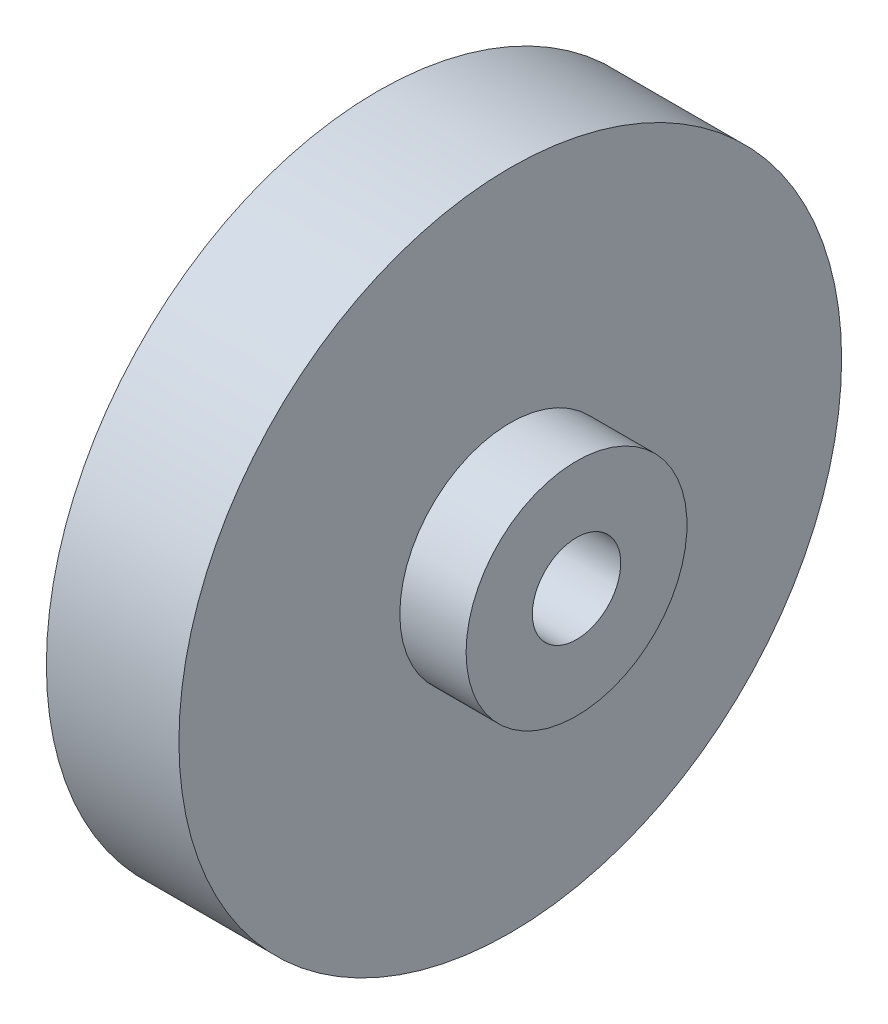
ISO-10303-21;
HEADER;
FILE_DESCRIPTION(('STEP AP214'),'2;1');
FILE_NAME('part.step','',(''),(''),'','','');
FILE_SCHEMA(('AUTOMOTIVE_DESIGN { 1 0 10303 214 1 1 1 1 }'));
ENDSEC;
DATA;
#1=APPLICATION_CONTEXT('core data for automotive mechanical design processes');
#2=APPLICATION_PROTOCOL_DEFINITION('international standard','automotive_design',2000,#1);
#3=PRODUCT_CONTEXT('',#1,'mechanical');
#4=PRODUCT('Part','Part','',(#3));
#5=PRODUCT_RELATED_PRODUCT_CATEGORY('part','',(#4));
#6=PRODUCT_DEFINITION_FORMATION('','',#4);
#7=PRODUCT_DEFINITION_CONTEXT('part definition',#1,'design');
#8=PRODUCT_DEFINITION('design','',#6,#7);
#9=PRODUCT_DEFINITION_SHAPE('','',#8);
#10=(LENGTH_UNIT() NAMED_UNIT(*) SI_UNIT(.MILLI.,.METRE.));
#11=(NAMED_UNIT(*) PLANE_ANGLE_UNIT() SI_UNIT($,.RADIAN.));
#12=(NAMED_UNIT(*) SI_UNIT($,.STERADIAN.) SOLID_ANGLE_UNIT());
#13=UNCERTAINTY_MEASURE_WITH_UNIT(LENGTH_MEASURE(1.E-05),#10,'distance_accuracy_value','');
#14=(GEOMETRIC_REPRESENTATION_CONTEXT(3) GLOBAL_UNCERTAINTY_ASSIGNED_CONTEXT((#13)) GLOBAL_UNIT_ASSIGNED_CONTEXT((#10,
#11,#12)) REPRESENTATION_CONTEXT('',''));
#15=CARTESIAN_POINT('',(0.,0.,0.));
#16=DIRECTION('',(0.,0.,1.));
#17=DIRECTION('',(1.,0.,0.));
#18=AXIS2_PLACEMENT_3D('',#15,#16,#17);
#19=CARTESIAN_POINT('',(0.,-7.58280683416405,0.));
#20=DIRECTION('',(1.,0.,0.));
#21=DIRECTION('',(0.,0.,-1.));
#22=AXIS2_PLACEMENT_3D('',#19,#20,#21);
#23=PLANE('',#22);
#24=CARTESIAN_POINT('',(0.,0.,0.));
#25=DIRECTION('',(-1.,0.,0.));
#26=DIRECTION('',(0.,0.,1.));
#27=AXIS2_PLACEMENT_3D('',#24,#25,#26);
#28=CIRCLE('',#27,2.);
#29=CARTESIAN_POINT('',(0.,0.,2.));
#30=VERTEX_POINT('',#29);
#31=EDGE_CURVE('E10',#30,#30,#28,.T.);
#32=ORIENTED_EDGE('',*,*,#31,.F.);
#33=EDGE_LOOP('',(#32));
#34=FACE_BOUND('',#33,.T.);
#35=CARTESIAN_POINT('',(0.,0.,0.));
#36=DIRECTION('',(-1.,0.,0.));
#37=DIRECTION('',(0.,0.,1.));
#38=AXIS2_PLACEMENT_3D('',#35,#36,#37);
#39=CIRCLE('',#38,5.);
#40=CARTESIAN_POINT('',(0.,0.,5.));
#41=VERTEX_POINT('',#40);
#42=EDGE_CURVE('E56',#41,#41,#39,.T.);
#43=ORIENTED_EDGE('',*,*,#42,.T.);
#44=EDGE_LOOP('',(#43));
#45=FACE_BOUND('',#44,.T.);
#46=ADVANCED_FACE('F28',(#34,#45),#23,.F.);
#47=CARTESIAN_POINT('',(0.,0.,0.));
#48=DIRECTION('',(-1.,0.,0.));
#49=DIRECTION('',(0.,0.,1.));
#50=AXIS2_PLACEMENT_3D('',#47,#48,#49);
#51=CYLINDRICAL_SURFACE('',#50,2.);
#52=CARTESIAN_POINT('',(12.,0.,0.));
#53=DIRECTION('',(-1.,0.,0.));
#54=DIRECTION('',(0.,0.,1.));
#55=AXIS2_PLACEMENT_3D('',#52,#53,#54);
#56=CIRCLE('',#55,2.);
#57=CARTESIAN_POINT('',(12.,0.,2.));
#58=VERTEX_POINT('',#57);
#59=EDGE_CURVE('E34',#58,#58,#56,.T.);
#60=ORIENTED_EDGE('',*,*,#59,.F.);
#61=EDGE_LOOP('',(#60));
#62=FACE_BOUND('',#61,.T.);
#63=ORIENTED_EDGE('',*,*,#31,.T.);
#64=EDGE_LOOP('',(#63));
#65=FACE_BOUND('',#64,.T.);
#66=ADVANCED_FACE('F93',(#62,#65),#51,.F.);
#67=CARTESIAN_POINT('',(12.,-7.58280683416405,0.));
#68=DIRECTION('',(-1.,0.,0.));
#69=DIRECTION('',(0.,0.,1.));
#70=AXIS2_PLACEMENT_3D('',#67,#68,#69);
#71=PLANE('',#70);
#72=CARTESIAN_POINT('',(12.,0.,0.));
#73=DIRECTION('',(-1.,0.,0.));
#74=DIRECTION('',(0.,0.,1.));
#75=AXIS2_PLACEMENT_3D('',#72,#73,#74);
#76=CIRCLE('',#75,5.);
#77=CARTESIAN_POINT('',(12.,0.,5.));
#78=VERTEX_POINT('',#77);
#79=EDGE_CURVE('E38',#78,#78,#76,.T.);
#80=ORIENTED_EDGE('',*,*,#79,.F.);
#81=EDGE_LOOP('',(#80));
#82=FACE_BOUND('',#81,.T.);
#83=ORIENTED_EDGE('',*,*,#59,.T.);
#84=EDGE_LOOP('',(#83));
#85=FACE_BOUND('',#84,.T.);
#86=ADVANCED_FACE('F88',(#82,#85),#71,.F.);
#87=CARTESIAN_POINT('',(0.,0.,0.));
#88=DIRECTION('',(-1.,0.,0.));
#89=DIRECTION('',(0.,0.,1.));
#90=AXIS2_PLACEMENT_3D('',#87,#88,#89);
#91=CYLINDRICAL_SURFACE('',#90,5.);
#92=CARTESIAN_POINT('',(9.,0.,0.));
#93=DIRECTION('',(-1.,0.,0.));
#94=DIRECTION('',(0.,0.,1.));
#95=AXIS2_PLACEMENT_3D('',#92,#93,#94);
#96=CIRCLE('',#95,5.);
#97=CARTESIAN_POINT('',(9.,0.,5.));
#98=VERTEX_POINT('',#97);
#99=EDGE_CURVE('E42',#98,#98,#96,.T.);
#100=ORIENTED_EDGE('',*,*,#99,.F.);
#101=EDGE_LOOP('',(#100));
#102=FACE_BOUND('',#101,.T.);
#103=ORIENTED_EDGE('',*,*,#79,.T.);
#104=EDGE_LOOP('',(#103));
#105=FACE_BOUND('',#104,.T.);
#106=ADVANCED_FACE('F82',(#102,#105),#91,.T.);
#107=CARTESIAN_POINT('',(9.,-7.58280683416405,0.));
#108=DIRECTION('',(-1.,0.,0.));
#109=DIRECTION('',(0.,0.,1.));
#110=AXIS2_PLACEMENT_3D('',#107,#108,#109);
#111=PLANE('',#110);
#112=CARTESIAN_POINT('',(9.,0.,0.));
#113=DIRECTION('',(-1.,0.,0.));
#114=DIRECTION('',(0.,0.,1.));
#115=AXIS2_PLACEMENT_3D('',#112,#113,#114);
#116=CIRCLE('',#115,15.);
#117=CARTESIAN_POINT('',(9.,0.,15.));
#118=VERTEX_POINT('',#117);
#119=EDGE_CURVE('E47',#118,#118,#116,.T.);
#120=ORIENTED_EDGE('',*,*,#119,.F.);
#121=EDGE_LOOP('',(#120));
#122=FACE_BOUND('',#121,.T.);
#123=ORIENTED_EDGE('',*,*,#99,.T.);
#124=EDGE_LOOP('',(#123));
#125=FACE_BOUND('',#124,.T.);
#126=ADVANCED_FACE('F76',(#122,#125),#111,.F.);
#127=CARTESIAN_POINT('',(0.,0.,0.));
#128=DIRECTION('',(-1.,0.,0.));
#129=DIRECTION('',(0.,0.,1.));
#130=AXIS2_PLACEMENT_3D('',#127,#128,#129);
#131=CYLINDRICAL_SURFACE('',#130,15.);
#132=CARTESIAN_POINT('',(3.,0.,0.));
#133=DIRECTION('',(-1.,0.,0.));
#134=DIRECTION('',(0.,0.,1.));
#135=AXIS2_PLACEMENT_3D('',#132,#133,#134);
#136=CIRCLE('',#135,15.);
#137=CARTESIAN_POINT('',(3.,0.,15.));
#138=VERTEX_POINT('',#137);
#139=EDGE_CURVE('E50',#138,#138,#136,.T.);
#140=ORIENTED_EDGE('',*,*,#139,.F.);
#141=EDGE_LOOP('',(#140));
#142=FACE_BOUND('',#141,.T.);
#143=ORIENTED_EDGE('',*,*,#119,.T.);
#144=EDGE_LOOP('',(#143));
#145=FACE_BOUND('',#144,.T.);
#146=ADVANCED_FACE('F70',(#142,#145),#131,.T.);
#147=CARTESIAN_POINT('',(3.,-7.58280683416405,0.));
#148=DIRECTION('',(1.,0.,0.));
#149=DIRECTION('',(0.,0.,-1.));
#150=AXIS2_PLACEMENT_3D('',#147,#148,#149);
#151=PLANE('',#150);
#152=CARTESIAN_POINT('',(3.,0.,0.));
#153=DIRECTION('',(-1.,0.,0.));
#154=DIRECTION('',(0.,0.,1.));
#155=AXIS2_PLACEMENT_3D('',#152,#153,#154);
#156=CIRCLE('',#155,5.);
#157=CARTESIAN_POINT('',(3.,0.,5.));
#158=VERTEX_POINT('',#157);
#159=EDGE_CURVE('E53',#158,#158,#156,.T.);
#160=ORIENTED_EDGE('',*,*,#159,.F.);
#161=EDGE_LOOP('',(#160));
#162=FACE_BOUND('',#161,.T.);
#163=ORIENTED_EDGE('',*,*,#139,.T.);
#164=EDGE_LOOP('',(#163));
#165=FACE_BOUND('',#164,.T.);
#166=ADVANCED_FACE('F64',(#162,#165),#151,.F.);
#167=CARTESIAN_POINT('',(0.,0.,0.));
#168=DIRECTION('',(-1.,0.,0.));
#169=DIRECTION('',(0.,0.,1.));
#170=AXIS2_PLACEMENT_3D('',#167,#168,#169);
#171=CYLINDRICAL_SURFACE('',#170,5.);
#172=ORIENTED_EDGE('',*,*,#42,.F.);
#173=EDGE_LOOP('',(#172));
#174=FACE_BOUND('',#173,.T.);
#175=ORIENTED_EDGE('',*,*,#159,.T.);
#176=EDGE_LOOP('',(#175));
#177=FACE_BOUND('',#176,.T.);
#178=ADVANCED_FACE('F61',(#174,#177),#171,.T.);
#179=CLOSED_SHELL('',(#46,#66,#86,#106,#126,#146,#166,#178));
#180=MANIFOLD_SOLID_BREP('B2',#179);
#181=ADVANCED_BREP_SHAPE_REPRESENTATION('',(#18,#180),#14);
#182=SHAPE_DEFINITION_REPRESENTATION(#9,#181);
ENDSEC;
END-ISO-10303-21;
